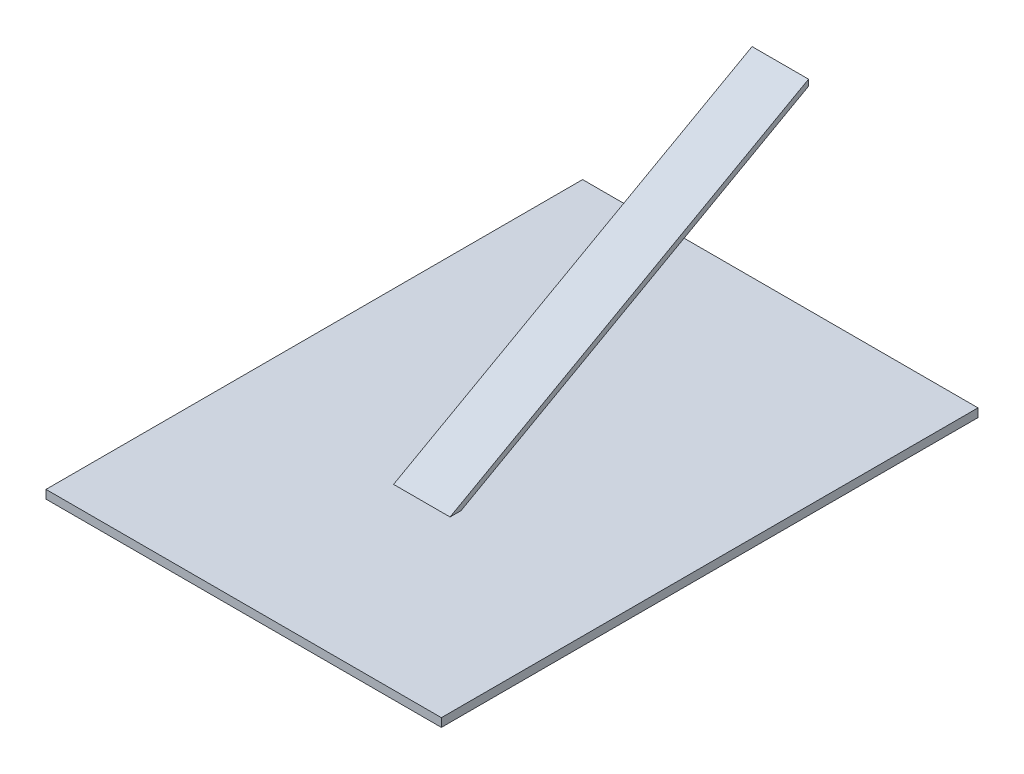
from build123d import *

# Parameters (mm, degrees)
SKETCH1_W           = 140
SKETCH1_H           = 190
BOSS_EXTRUDE1_DEPTH = 3
BOSS_EXTRUDE2_DEPTH = 10


with BuildPart() as part:
    # Sketch1 → Boss-Extrude1 (new body)
    with BuildSketch(Plane(origin=(0, 0, 0), x_dir=(1, 0, 0), z_dir=(0, 1, 0))):
        with Locations((0, 95)):
            Rectangle(SKETCH1_W, SKETCH1_H)
    extrude(amount=-BOSS_EXTRUDE1_DEPTH)

    # Sketch2 → Boss-Extrude2 (add, symmetric)
    with BuildSketch(Plane(origin=(0, 0, 0), x_dir=(0, 0, -1), z_dir=(1, 0, 0))):
        Polygon((190, 70.784048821), (63.062416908, 0), (66.943439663, 0), (190, 68.619878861), align=None)
    extrude(amount=BOSS_EXTRUDE2_DEPTH, both=True)


solid = part.part
